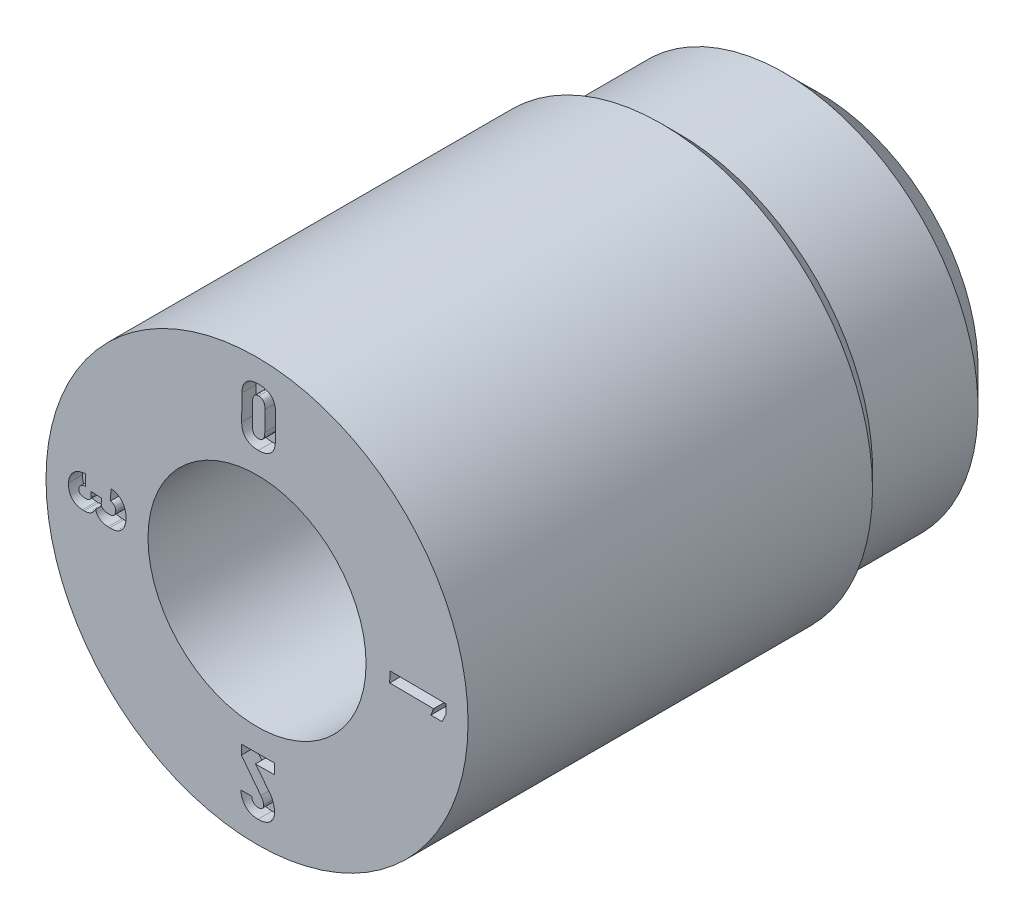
from build123d import *

# Parameters (mm, degrees)
CUT_EXTRUDE1_DEPTH = 0.2


with BuildPart() as part:
    # Sketch2 → Revolve1 (revolve)
    with BuildSketch(Plane(origin=(0, 0, 0), x_dir=(1, 0, 0), z_dir=(0, 1, 0)), mode=Mode.PRIVATE) as revolve1_sk:
        Polygon((2.249621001, 7.999984), (0.8, 7.999984), (0.8, 5.499984), (1.55, 5.499984), (1.55, 0), (3, 0), (3, 5.749984), (2.75, 5.999984), (2.75, 7.499605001), align=None)
    revolve(revolve1_sk.sketch.rotate(Axis((0, 0, -4.849143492), (0, 0, 1)), 180), axis=Axis((0, 0, -4.849143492), (0, 0, 1)))

    # Sketch7 → Cut-Extrude1 (cut)
    # profile 1 of 4: a face of its own
    with BuildSketch(Plane.XY):
        with BuildLine():
            add(Edge.make_bspline(
                [(0.018995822, 1.861849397), (0.028464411, 1.861959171), (0.046907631, 1.862172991), (0.073674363, 1.864759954), (0.098765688, 1.86909935), (0.122139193, 1.875423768), (0.143715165, 1.883882), (0.16370522, 1.893882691), (0.181869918, 1.905998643), (0.198133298, 1.920129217), (0.212724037, 1.935784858), (0.225131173, 1.953182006), (0.235853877, 1.971853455), (0.244826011, 1.991958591), (0.251508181, 2.013702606), (0.256535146, 2.036777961), (0.259680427, 2.06132913), (0.260151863, 2.078171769), (0.260393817, 2.0868159)],
                knots=[0, 0, 0, 0, 1.209324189, 2.355560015, 3.431224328, 4.459322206, 5.443071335, 6.38729278, 7.309850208, 8.224299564, 9.13412492, 10.037356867, 10.947738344, 11.881280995, 12.843554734, 13.848416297, 14.895744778, 16, 16, 16, 16], degree=3))
            Line((0.260393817, 2.0868159), (0.263862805, 2.450543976))
            add(Edge.make_bspline(
                [(0.263862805, 2.450543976), (0.263736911, 2.45930633), (0.263492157, 2.476341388), (0.260890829, 2.501176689), (0.256275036, 2.524499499), (0.249952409, 2.546422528), (0.241478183, 2.566818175), (0.231044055, 2.58574343), (0.218633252, 2.603165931), (0.204328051, 2.619021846), (0.188291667, 2.633316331), (0.170256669, 2.645544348), (0.150626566, 2.656174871), (0.129130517, 2.664648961), (0.105985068, 2.671535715), (0.081067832, 2.676339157), (0.0544053, 2.679324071), (0.036052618, 2.679848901), (0.026594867, 2.680119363)],
                knots=[0, 0, 0, 0, 1.118070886, 2.173662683, 3.181769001, 4.149158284, 5.080880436, 5.994536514, 6.901772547, 7.804676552, 8.714982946, 9.636451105, 10.579464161, 11.558494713, 12.579875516, 13.657478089, 14.792820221, 16, 16, 16, 16], degree=3))
            add(Edge.make_bspline(
                [(0.026594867, 2.680119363), (0.017127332, 2.680077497), (-0.001316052, 2.679995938), (-0.02808367, 2.677375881), (-0.053144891, 2.67298893), (-0.076488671, 2.666903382), (-0.09802937, 2.658567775), (-0.117891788, 2.648548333), (-0.136098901, 2.636631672), (-0.152369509, 2.622661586), (-0.166922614, 2.607108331), (-0.179586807, 2.589960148), (-0.190220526, 2.571243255), (-0.199250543, 2.551110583), (-0.205890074, 2.529239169), (-0.210945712, 2.505953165), (-0.214083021, 2.481073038), (-0.214558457, 2.463959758), (-0.214803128, 2.455152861)],
                knots=[0, 0, 0, 0, 1.207415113, 2.352124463, 3.426356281, 4.451140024, 5.424533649, 6.367497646, 7.284878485, 8.193492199, 9.096932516, 9.997254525, 10.906423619, 11.838723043, 12.806370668, 13.81669749, 14.876421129, 16, 16, 16, 16], degree=3))
            Line((-0.214803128, 2.455152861), (-0.218272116, 2.091424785))
            add(Edge.make_bspline(
                [(-0.218272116, 2.091424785), (-0.218146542, 2.082662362), (-0.21790241, 2.065627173), (-0.215296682, 2.040792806), (-0.210706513, 2.017517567), (-0.204330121, 1.995585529), (-0.195733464, 1.975221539), (-0.185297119, 1.956219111), (-0.172877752, 1.938800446), (-0.158574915, 1.922943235), (-0.142537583, 1.90865013), (-0.124504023, 1.896417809), (-0.10486895, 1.885803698), (-0.083405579, 1.877270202), (-0.060248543, 1.870658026), (-0.035416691, 1.865810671), (-0.008824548, 1.862593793), (0.009536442, 1.862102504), (0.018995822, 1.861849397)],
                knots=[0, 0, 0, 0, 1.118452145, 2.174403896, 3.182853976, 4.143959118, 5.085147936, 5.999115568, 6.906660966, 7.809872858, 8.720489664, 9.642272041, 10.585606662, 11.56497106, 12.58488454, 13.65602248, 14.792408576, 16, 16, 16, 16], degree=3))
        make_face()
        with BuildLine():
            add(Edge.make_bspline(
                [(0.020248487, 2.007115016), (0.016547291, 2.007201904), (0.009383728, 2.007370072), (-0.000884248, 2.009167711), (-0.010434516, 2.011565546), (-0.019218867, 2.015058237), (-0.027383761, 2.0193467), (-0.034448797, 2.025062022), (-0.040954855, 2.03141021), (-0.048787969, 2.041432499), (-0.056569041, 2.05659955), (-0.062928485, 2.077716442), (-0.066602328, 2.102061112), (-0.066880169, 2.119384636), (-0.067026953, 2.128536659)],
                knots=[0, 0, 0, 0, 0.78120511, 1.512000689, 2.197162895, 2.858428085, 3.505583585, 4.137167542, 4.77073188, 5.423567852, 6.816654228, 8.341822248, 10.067383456, 12, 12, 12, 12], degree=3))
            Line((-0.067026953, 2.128536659), (-0.06443627, 2.415152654))
            add(Edge.make_bspline(
                [(-0.06443627, 2.415152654), (-0.064154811, 2.424346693), (-0.063624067, 2.441683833), (-0.059442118, 2.465985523), (-0.052635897, 2.486906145), (-0.04443317, 2.501822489), (-0.036465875, 2.511653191), (-0.029932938, 2.518090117), (-0.02240419, 2.523150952), (-0.014444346, 2.527831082), (-0.005467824, 2.530871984), (0.004080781, 2.533448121), (0.014484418, 2.53459107), (0.021641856, 2.534764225), (0.025342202, 2.534853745)],
                knots=[0, 0, 0, 0, 1.940432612, 3.659061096, 5.186910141, 6.567922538, 7.222076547, 7.854951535, 8.495272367, 9.132914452, 9.797749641, 10.488136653, 11.218377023, 12, 12, 12, 12], degree=3))
            add(Edge.make_bspline(
                [(0.025342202, 2.534853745), (0.02903869, 2.534741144), (0.036185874, 2.53452343), (0.046523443, 2.533073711), (0.055993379, 2.53033749), (0.064824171, 2.526940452), (0.072907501, 2.52258719), (0.080155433, 2.517092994), (0.086479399, 2.510544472), (0.094374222, 2.50062862), (0.101949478, 2.485411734), (0.108590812, 2.464458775), (0.112174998, 2.440062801), (0.112466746, 2.422744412), (0.112620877, 2.413595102)],
                knots=[0, 0, 0, 0, 0.781827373, 1.511668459, 2.200163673, 2.861955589, 3.509626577, 4.134885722, 4.776924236, 5.43028022, 6.808852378, 8.338908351, 10.065844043, 12, 12, 12, 12], degree=3))
            Line((0.112620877, 2.413595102), (0.110030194, 2.126979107))
            add(Edge.make_bspline(
                [(0.110030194, 2.126979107), (0.10967622, 2.11778861), (0.109008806, 2.100459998), (0.104908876, 2.07613396), (0.097971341, 2.055255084), (0.090068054, 2.040148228), (0.08205228, 2.030316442), (0.075521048, 2.023885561), (0.067970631, 2.018762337), (0.059938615, 2.014228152), (0.05102253, 2.011052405), (0.041506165, 2.008529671), (0.031107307, 2.00737519), (0.023949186, 2.007203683), (0.020248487, 2.007115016)],
                knots=[0, 0, 0, 0, 1.940153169, 3.658143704, 5.185425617, 6.570682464, 7.224593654, 7.857233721, 8.497316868, 9.144655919, 9.798567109, 10.488697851, 11.218667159, 12, 12, 12, 12], degree=3))
        make_face(mode=Mode.SUBTRACT)
    # profile 2 of 4: a face of its own
    with BuildSketch(Plane.XY):
        Polygon((1.887836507, 0.083091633), (1.886481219, -0.067549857), (2.50942593, -0.07316776), (2.471511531, -0.170333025), (2.631773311, -0.171695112), (2.686705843, -0.052654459), (2.687835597, 0.075978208), align=None)
    # profile 3 of 4: a face of its own
    with BuildSketch(Plane.XY):
        with BuildLine():
            Line((-0.222498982, -2.010598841), (0.053872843, -2.370146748))
            add(Edge.make_bspline(
                [(0.053872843, -2.370146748), (0.059680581, -2.378148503), (0.070993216, -2.393734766), (0.081440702, -2.415104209), (0.087621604, -2.431968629), (0.09079439, -2.444120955), (0.093067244, -2.455812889), (0.093261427, -2.463543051), (0.093355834, -2.467301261)],
                knots=[0, 0, 0, 0, 1.666872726, 3.246827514, 3.995521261, 4.696536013, 5.366288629, 6, 6, 6, 6], degree=3))
            Line((0.093355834, -2.467301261), (0.093365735, -2.468442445))
            add(Edge.make_bspline(
                [(0.093365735, -2.468442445), (0.09319156, -2.473581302), (0.092859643, -2.483374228), (0.088953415, -2.497179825), (0.082403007, -2.509152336), (0.073158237, -2.519195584), (0.061372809, -2.527071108), (0.047264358, -2.532455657), (0.031118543, -2.535926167), (0.019626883, -2.536282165), (0.0135779, -2.536469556)],
                knots=[0, 0, 0, 0, 1.032650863, 1.967884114, 2.859905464, 3.758284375, 4.690309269, 5.688385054, 6.78321168, 8, 8, 8, 8], degree=3))
            add(Edge.make_bspline(
                [(0.0135779, -2.536469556), (0.007622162, -2.536201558), (-0.003931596, -2.53568166), (-0.020406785, -2.531212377), (-0.035071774, -2.523490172), (-0.047652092, -2.51257653), (-0.058421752, -2.498979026), (-0.066334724, -2.482433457), (-0.072588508, -2.463600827), (-0.074562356, -2.450001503), (-0.075601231, -2.442843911)],
                knots=[0, 0, 0, 0, 0.99457823, 1.929419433, 2.827918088, 3.742536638, 4.694877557, 5.70673835, 6.793011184, 8, 8, 8, 8], degree=3))
            Line((-0.075601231, -2.442843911), (-0.230160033, -2.443043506))
            add(Edge.make_bspline(
                [(-0.230160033, -2.443043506), (-0.228997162, -2.455729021), (-0.226743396, -2.479165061), (-0.219271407, -2.512835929), (-0.20834003, -2.543876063), (-0.194252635, -2.572190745), (-0.177235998, -2.597662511), (-0.157260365, -2.619920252), (-0.134534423, -2.638991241), (-0.109191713, -2.654748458), (-0.081580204, -2.667192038), (-0.051710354, -2.67559853), (-0.019956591, -2.681129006), (0.001983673, -2.681533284), (0.013207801, -2.681740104)],
                knots=[0, 0, 0, 0, 1.143196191, 2.226467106, 3.25429223, 4.250165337, 5.211501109, 6.144227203, 7.070723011, 8.009440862, 8.959820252, 9.926245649, 10.939115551, 12, 12, 12, 12], degree=3))
            add(Edge.make_bspline(
                [(0.013207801, -2.681740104), (0.025232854, -2.681459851), (0.048508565, -2.680917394), (0.081994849, -2.675907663), (0.112831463, -2.668306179), (0.140813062, -2.657456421), (0.165842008, -2.643678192), (0.187902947, -2.627069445), (0.206590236, -2.607433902), (0.222298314, -2.585256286), (0.2343657, -2.560292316), (0.242612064, -2.532854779), (0.247971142, -2.503196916), (0.248391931, -2.482613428), (0.248609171, -2.471986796)],
                knots=[0, 0, 0, 0, 1.208128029, 2.338454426, 3.395807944, 4.395205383, 5.34612391, 6.259550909, 7.159697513, 8.060225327, 8.981298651, 9.933268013, 10.933008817, 12, 12, 12, 12], degree=3))
            add(Edge.make_bspline(
                [(0.248609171, -2.471986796), (0.248301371, -2.462251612), (0.247696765, -2.444075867), (0.243948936, -2.41692615), (0.237763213, -2.389958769), (0.229414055, -2.363264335), (0.218997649, -2.337212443), (0.206501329, -2.312298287), (0.192149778, -2.288664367), (0.181096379, -2.27401377), (0.1755804, -2.26670268)],
                knots=[0, 0, 0, 0, 0.985692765, 1.972425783, 2.968349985, 3.985078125, 5.00462423, 6.009465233, 7.006663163, 8, 8, 8, 8], degree=3))
            Line((0.1755804, -2.26670268), (-0.022704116, -2.018973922))
            Line((-0.022704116, -2.018973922), (0.250698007, -2.017417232))
            Line((0.250698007, -2.017417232), (0.249926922, -1.872156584))
            Line((0.249926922, -1.872156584), (-0.22318945, -1.874630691))
            Line((-0.22318945, -1.874630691), (-0.222498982, -2.010598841))
        make_face()
    # profile 4 of 4: a face of its own
    with BuildSketch(Plane.XY):
        with BuildLine():
            add(Edge.make_bspline(
                [(-1.863069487, 0.077903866), (-1.862902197, 0.089693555), (-1.86257557, 0.112712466), (-1.866053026, 0.146495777), (-1.873099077, 0.178389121), (-1.883351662, 0.208349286), (-1.896980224, 0.235959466), (-1.91384557, 0.260917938), (-1.933898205, 0.283157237), (-1.957078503, 0.302351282), (-1.983068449, 0.318602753), (-2.011923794, 0.330861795), (-2.043282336, 0.339629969), (-2.065200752, 0.342354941), (-2.076456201, 0.343754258)],
                knots=[0, 0, 0, 0, 1.113290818, 2.173657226, 3.200029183, 4.193127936, 5.158184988, 6.100353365, 7.030214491, 7.977447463, 8.93497705, 9.915641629, 10.929649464, 12, 12, 12, 12], degree=3))
            Line((-2.076456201, 0.343754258), (-2.082869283, 0.188060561))
            add(Edge.make_bspline(
                [(-2.082869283, 0.188060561), (-2.07888971, 0.187215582), (-2.071181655, 0.185578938), (-2.060293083, 0.181882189), (-2.050418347, 0.177279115), (-2.041476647, 0.171844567), (-2.033637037, 0.165361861), (-2.026625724, 0.158321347), (-2.020845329, 0.150355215), (-2.016127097, 0.141719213), (-2.01240735, 0.132372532), (-2.010077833, 0.122292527), (-2.008488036, 0.111613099), (-2.008669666, 0.104277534), (-2.008763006, 0.100507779)],
                knots=[0, 0, 0, 0, 1.156088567, 2.239234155, 3.261121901, 4.249390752, 5.205232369, 6.147233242, 7.067434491, 7.993198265, 8.940003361, 9.917338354, 10.929717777, 12, 12, 12, 12], degree=3))
            add(Edge.make_bspline(
                [(-2.008763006, 0.100507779), (-2.009275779, 0.093768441), (-2.010257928, 0.080860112), (-2.015713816, 0.062959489), (-2.023952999, 0.047532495), (-2.035117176, 0.034835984), (-2.048976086, 0.024954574), (-2.065310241, 0.018244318), (-2.083889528, 0.014451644), (-2.096979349, 0.014540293), (-2.103829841, 0.014586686)],
                knots=[0, 0, 0, 0, 1.112408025, 2.130673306, 3.062011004, 3.978380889, 4.894531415, 5.845008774, 6.872196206, 8, 8, 8, 8], degree=3))
            Line((-2.103829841, 0.014586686), (-2.122569, 0.015472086))
            add(Edge.make_bspline(
                [(-2.122569, 0.015472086), (-2.12973489, 0.015973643), (-2.143318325, 0.016924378), (-2.162312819, 0.021268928), (-2.178788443, 0.027691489), (-2.192378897, 0.036751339), (-2.203028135, 0.047860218), (-2.210470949, 0.061100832), (-2.214496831, 0.076300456), (-2.214637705, 0.087009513), (-2.21471079, 0.092565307)],
                knots=[0, 0, 0, 0, 1.265953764, 2.399701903, 3.424832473, 4.369284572, 5.258832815, 6.115252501, 7.022204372, 8, 8, 8, 8], degree=3))
            Line((-2.21471079, 0.092565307), (-2.211932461, 0.160223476))
            Line((-2.211932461, 0.160223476), (-2.357187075, 0.166269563))
            Line((-2.357187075, 0.166269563), (-2.359965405, 0.098611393))
            add(Edge.make_bspline(
                [(-2.359965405, 0.098611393), (-2.360392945, 0.094096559), (-2.361217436, 0.085389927), (-2.365935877, 0.073225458), (-2.37352073, 0.062982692), (-2.383653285, 0.054695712), (-2.395969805, 0.048279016), (-2.410512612, 0.044179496), (-2.42705542, 0.041933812), (-2.438749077, 0.042057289), (-2.444925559, 0.042122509)],
                knots=[0, 0, 0, 0, 0.943076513, 1.818675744, 2.684301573, 3.574543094, 4.527929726, 5.562088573, 6.712317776, 8, 8, 8, 8], degree=3))
            Line((-2.444925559, 0.042122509), (-2.458776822, 0.04276987))
            add(Edge.make_bspline(
                [(-2.458776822, 0.04276987), (-2.464588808, 0.043170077), (-2.475579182, 0.043926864), (-2.490968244, 0.047852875), (-2.504272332, 0.05375899), (-2.515322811, 0.061954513), (-2.523784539, 0.072124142), (-2.529741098, 0.084010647), (-2.53312682, 0.097530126), (-2.533094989, 0.10707509), (-2.533078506, 0.112017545)],
                knots=[0, 0, 0, 0, 1.211192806, 2.29034666, 3.28918339, 4.22492228, 5.1292672, 6.018255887, 6.973837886, 8, 8, 8, 8], degree=3))
            add(Edge.make_bspline(
                [(-2.533078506, 0.112017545), (-2.532774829, 0.115322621), (-2.532174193, 0.121859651), (-2.529940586, 0.131456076), (-2.526200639, 0.140498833), (-2.521210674, 0.149012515), (-2.514969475, 0.15683503), (-2.507623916, 0.1639881), (-2.499115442, 0.170318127), (-2.489652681, 0.176200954), (-2.478877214, 0.18088006), (-2.467239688, 0.185132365), (-2.454483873, 0.18805962), (-2.445646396, 0.189458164), (-2.441103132, 0.190177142)],
                knots=[0, 0, 0, 0, 0.905413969, 1.790796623, 2.677545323, 3.56664861, 4.475943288, 5.401192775, 6.35720846, 7.366089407, 8.435230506, 9.557398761, 10.744281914, 12, 12, 12, 12], degree=3))
            Line((-2.441103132, 0.190177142), (-2.434567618, 0.345370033))
            add(Edge.make_bspline(
                [(-2.434567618, 0.345370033), (-2.446477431, 0.34450229), (-2.469649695, 0.342813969), (-2.502973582, 0.335627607), (-2.534062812, 0.325711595), (-2.562541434, 0.312079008), (-2.58839758, 0.295617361), (-2.611163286, 0.276107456), (-2.630941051, 0.254042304), (-2.647573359, 0.22942322), (-2.660881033, 0.202667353), (-2.670789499, 0.174078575), (-2.67728393, 0.143828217), (-2.678827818, 0.123022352), (-2.679612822, 0.112443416)],
                knots=[0, 0, 0, 0, 1.144928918, 2.227625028, 3.263258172, 4.270656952, 5.24927106, 6.19720934, 7.139273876, 8.085200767, 9.040273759, 9.999270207, 10.982710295, 12, 12, 12, 12], degree=3))
            add(Edge.make_bspline(
                [(-2.679612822, 0.112443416), (-2.679775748, 0.103832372), (-2.680092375, 0.087097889), (-2.678736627, 0.062613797), (-2.675327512, 0.039612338), (-2.670530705, 0.017940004), (-2.663584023, -0.002217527), (-2.654976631, -0.020945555), (-2.644774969, -0.038370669), (-2.632545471, -0.054089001), (-2.618817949, -0.068349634), (-2.603590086, -0.08096694), (-2.586806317, -0.091770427), (-2.56842957, -0.100583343), (-2.548633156, -0.107773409), (-2.527402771, -0.11326747), (-2.504648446, -0.116976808), (-2.488936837, -0.117879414), (-2.480848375, -0.118344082)],
                knots=[0, 0, 0, 0, 1.192534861, 2.317541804, 3.391021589, 4.409733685, 5.387101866, 6.337408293, 7.260411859, 8.176733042, 9.08862386, 9.996811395, 10.909230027, 11.845636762, 12.813307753, 13.821709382, 14.878598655, 16, 16, 16, 16], degree=3))
            Line((-2.480848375, -0.118344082), (-2.456720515, -0.119345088))
            add(Edge.make_bspline(
                [(-2.456720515, -0.119345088), (-2.447692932, -0.119428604), (-2.430138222, -0.119591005), (-2.404499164, -0.115313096), (-2.380552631, -0.107413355), (-2.358387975, -0.095869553), (-2.338256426, -0.081118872), (-2.320560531, -0.063140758), (-2.305382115, -0.042093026), (-2.297737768, -0.026301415), (-2.293826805, -0.018222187)],
                knots=[0, 0, 0, 0, 1.056950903, 2.055308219, 3.031727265, 4.002328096, 4.973409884, 5.945912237, 6.949097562, 8, 8, 8, 8], degree=3))
            add(Edge.make_bspline(
                [(-2.293826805, -0.018222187), (-2.292819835, -0.022964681), (-2.290835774, -0.032308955), (-2.286573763, -0.045805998), (-2.28093114, -0.058450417), (-2.274463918, -0.070434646), (-2.266847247, -0.081658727), (-2.257867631, -0.091861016), (-2.248098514, -0.101550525), (-2.23713526, -0.110334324), (-2.225104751, -0.118106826), (-2.212397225, -0.125318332), (-2.198545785, -0.131099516), (-2.184088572, -0.136277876), (-2.168631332, -0.140221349), (-2.152496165, -0.143652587), (-2.135364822, -0.145558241), (-2.123702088, -0.146318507), (-2.1177371, -0.14670735)],
                knots=[0, 0, 0, 0, 0.980180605, 1.931278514, 2.855779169, 3.776351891, 4.682643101, 5.591928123, 6.520665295, 7.46257487, 8.426539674, 9.41524775, 10.412713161, 11.457668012, 12.518340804, 13.636178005, 14.791006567, 16, 16, 16, 16], degree=3))
            Line((-2.1177371, -0.14670735), (-2.09360924, -0.147708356))
            add(Edge.make_bspline(
                [(-2.09360924, -0.147708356), (-2.082358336, -0.147852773), (-2.060558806, -0.148132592), (-2.028949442, -0.144327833), (-1.999761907, -0.136930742), (-1.973105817, -0.125916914), (-1.948861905, -0.111694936), (-1.927646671, -0.093645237), (-1.908954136, -0.072591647), (-1.893610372, -0.048012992), (-1.88099369, -0.020646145), (-1.871755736, 0.009733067), (-1.86534325, 0.042831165), (-1.863843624, 0.065962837), (-1.863069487, 0.077903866)],
                knots=[0, 0, 0, 0, 1.103878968, 2.138854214, 3.115922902, 4.051411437, 4.962006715, 5.863788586, 6.775180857, 7.715587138, 8.698017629, 9.725912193, 10.826070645, 12, 12, 12, 12], degree=3))
        make_face()
    extrude(amount=-CUT_EXTRUDE1_DEPTH, mode=Mode.SUBTRACT)


solid = part.part
